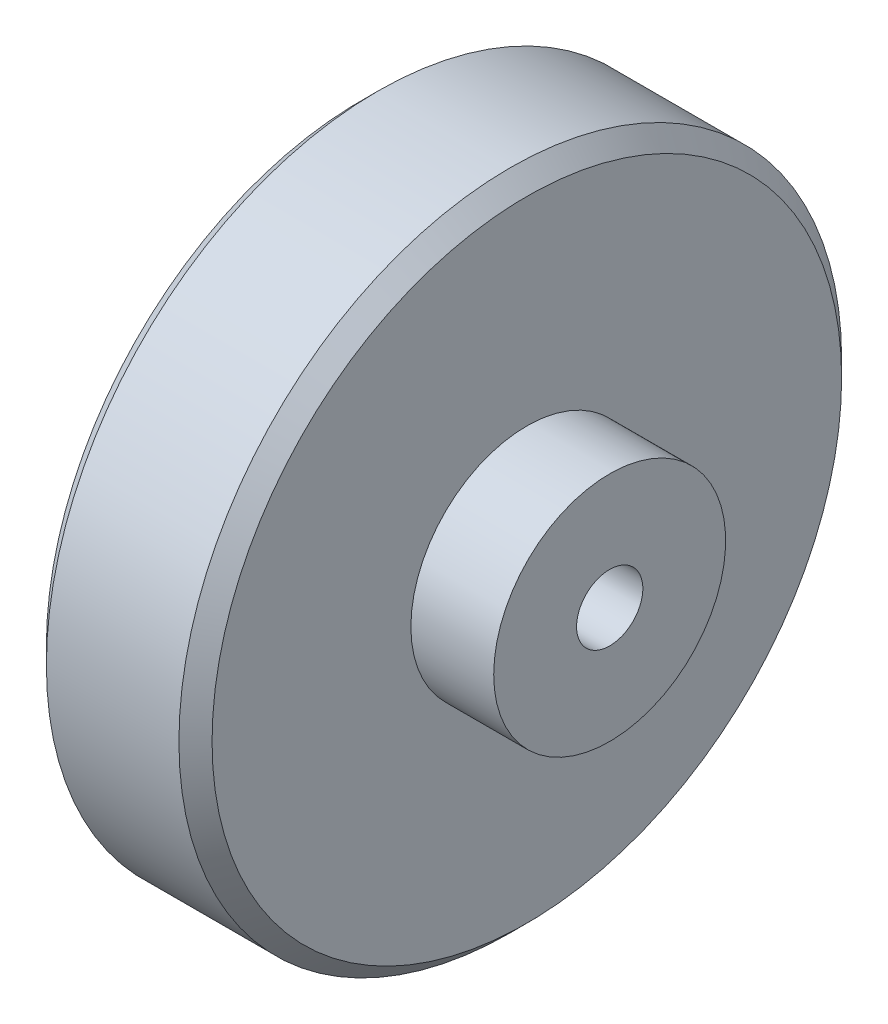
from build123d import *

# Parameters (mm, degrees)
CHAMFER1_SIZE = 1


with BuildPart() as part:
    # Sketch1 → Revolve1 (revolve)
    with BuildSketch(Plane.XY, mode=Mode.PRIVATE) as revolve1_sk:
        Polygon((0, 20), (0, 2), (15, 2), (15, 7), (10, 7), (10, 20), align=None)
    revolve(revolve1_sk.sketch.rotate(Axis((0, 0, 0), (1, 0, 0)), 90), axis=Axis((0, 0, 0), (1, 0, 0)))

    # Chamfer1
    chamfer1_edges = [part.edges().sort_by_distance(p)[0] for p in [
        (0, 0, -20),
        (10, 0, -20),
    ]]
    chamfer(chamfer1_edges, length=CHAMFER1_SIZE)


solid = part.part
